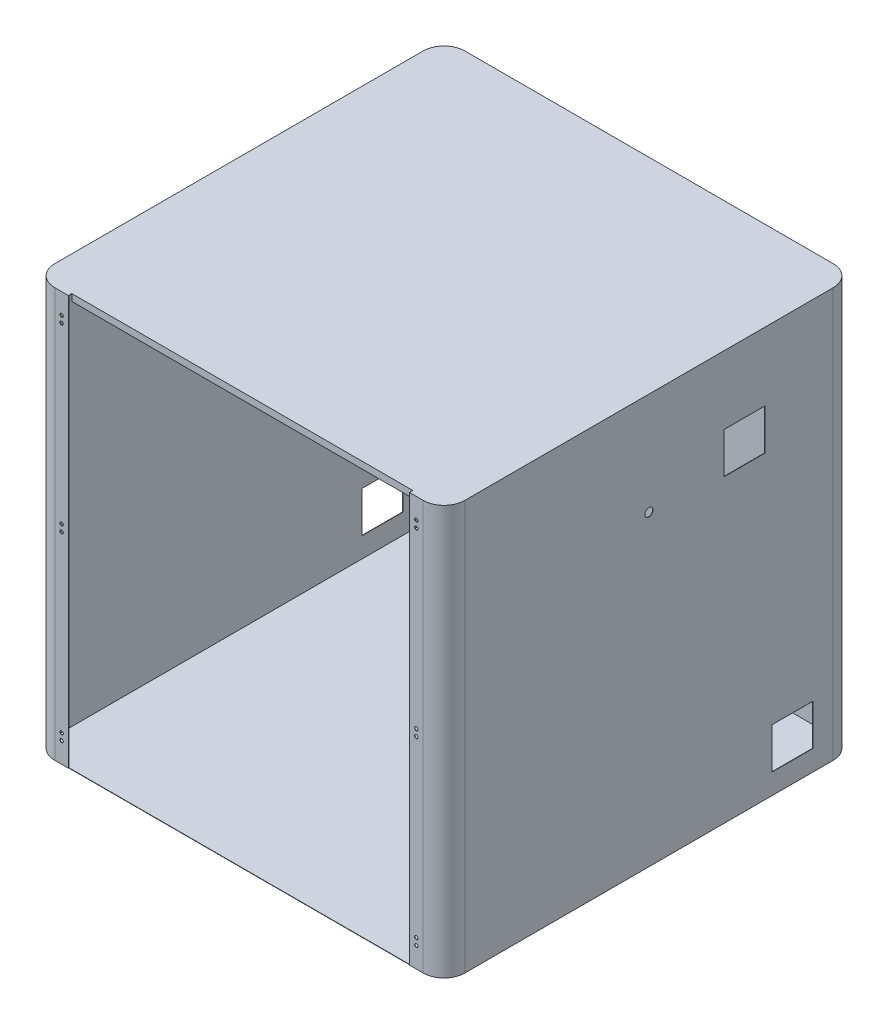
from build123d import *

# Parameters (mm, degrees)
EXTRUDE_THIN1_DEPTH = 600
SKETCH2_W           = 500
SKETCH2_H           = 600
CUT_EXTRUDE1_DEPTH  = 10
BOSS_EXTRUDE1_START = -0.5
BOSS_EXTRUDE1_DEPTH = 0.5
SKETCH5_W           = 60
SKETCH5_H           = 60
CUT_EXTRUDE2_DEPTH  = 0.5
SKETCH6_W           = 60
SKETCH6_H           = 60
CUT_EXTRUDE4_DEPTH  = 794.5
SKETCH8_W           = 500
SKETCH8_H           = 5
CUT_EXTRUDE5_DEPTH  = 78
SKETCH9_W           = 500
SKETCH9_H           = 10
BOSS_EXTRUDE6_DEPTH = 0.5
SKETCH11_R          = 2.5
CUT_EXTRUDE6_DEPTH  = 0.5
SKETCH7_R           = 6
CUT_EXTRUDE7_DEPTH  = 10


with BuildPart() as part:
    # Sketch1 → Extrude-Thin1 (new body)
    with BuildSketch(Plane(origin=(0, 0, 0), x_dir=(1, 0, 0), z_dir=(0, 1, 0))):
        with BuildLine():
            Line((-300.5, 270), (-300.5, -270))
            ThreePointArc((-300.5, -270), (-291.566756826, -291.566756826), (-270, -300.5))
            Line((-270, -300.5), (270, -300.5))
            ThreePointArc((270, -300.5), (291.566756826, -291.566756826), (300.5, -270))
            Line((300.5, -270), (300.5, 270))
            ThreePointArc((300.5, 270), (291.566756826, 291.566756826), (270, 300.5))
            Line((270, 300.5), (-270, 300.5))
            ThreePointArc((-270, 300.5), (-291.566756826, 291.566756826), (-300.5, 270))
        make_face()
        with BuildLine():
            Line((-300, 270), (-300, -270))
            ThreePointArc((-300, -270), (-291.213203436, -291.213203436), (-270, -300))
            Line((-270, -300), (270, -300))
            ThreePointArc((270, -300), (291.213203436, -291.213203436), (300, -270))
            Line((300, -270), (300, 270))
            ThreePointArc((300, 270), (291.213203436, 291.213203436), (270, 300))
            Line((270, 300), (-270, 300))
            ThreePointArc((-270, 300), (-291.213203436, 291.213203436), (-300, 270))
        make_face(mode=Mode.SUBTRACT)
    extrude(amount=EXTRUDE_THIN1_DEPTH)

    # Sketch2 → Cut-Extrude1 (cut)
    with BuildSketch(Plane.XY.offset(300.5)):
        with Locations((0, 300)):
            Rectangle(SKETCH2_W, SKETCH2_H)
    extrude(amount=-CUT_EXTRUDE1_DEPTH, mode=Mode.SUBTRACT)

    # Sketch3 → Boss-Extrude1 (add)
    with BuildSketch(Plane(origin=(0, 600, 0), x_dir=(1, 0, 0), z_dir=(0, 1, 0)).offset(BOSS_EXTRUDE1_START)):
        with BuildLine():
            Line((270, 300), (-270, 300))
            ThreePointArc((-270, 300), (-291.213203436, 291.213203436), (-300, 270))
            Line((-300, 270), (-300, -270))
            ThreePointArc((-300, -270), (-291.213203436, -291.213203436), (-270, -300))
            Line((-270, -300), (270, -300))
            ThreePointArc((270, -300), (291.213203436, -291.213203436), (300, -270))
            Line((300, -270), (300, 270))
            ThreePointArc((300, 270), (291.213203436, 291.213203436), (270, 300))
        make_face()
    boss_extrude1 = extrude(amount=BOSS_EXTRUDE1_DEPTH)

    # Mirror1: Boss-Extrude1 across plane
    add(boss_extrude1.mirror(Plane.ZX.offset(300)))

    # Sketch5 → Cut-Extrude2 (cut)
    with BuildSketch(Plane(origin=(300.5, 0, 0), x_dir=(0, 0, -1), z_dir=(1, 0, 0))):
        with Locations((140, 470)):
            Rectangle(SKETCH5_W, SKETCH5_H)
    extrude(amount=-CUT_EXTRUDE2_DEPTH, mode=Mode.SUBTRACT)

    # Sketch6 → Cut-Extrude4 (cut)
    with BuildSketch(Plane.ZY.offset(300.5)):
        with Locations((-210, 60)):
            Rectangle(SKETCH6_W, SKETCH6_H)
    extrude(amount=-CUT_EXTRUDE4_DEPTH, mode=Mode.SUBTRACT)

    # Sketch8 → Cut-Extrude5 (cut)
    with BuildSketch(Plane(origin=(0, 600, 0), x_dir=(1, 0, 0), z_dir=(0, 1, 0))):
        with Locations((0, -298)):
            Rectangle(SKETCH8_W, SKETCH8_H)
    extrude(amount=-CUT_EXTRUDE5_DEPTH, mode=Mode.SUBTRACT)

    # Sketch9 → Boss-Extrude6 (add)
    with BuildSketch(Plane.XY.offset(295.5)):
        with Locations((0, 595)):
            Rectangle(SKETCH9_W, SKETCH9_H)
    extrude(amount=-BOSS_EXTRUDE6_DEPTH)

    # Sketch11 → Cut-Extrude6 (cut)
    with BuildSketch(Plane.XY.offset(300.5)):
        with Locations((-260, 30)):
            Circle(SKETCH11_R)
        with Locations((-260, 40)):
            Circle(SKETCH11_R)
        with Locations(Location((-260, 295, 0), (0, 0, 180))):
            Circle(SKETCH11_R)
        with Locations(Location((-260, 305, 0), (0, 0, 180))):
            Circle(SKETCH11_R)
        with Locations(Location((-260, 570, 0), (0, 0, 180))):
            Circle(SKETCH11_R)
        with Locations(Location((-260, 560, 0), (0, 0, 180))):
            Circle(SKETCH11_R)
        with Locations((260, 560)):
            Circle(SKETCH11_R)
        with Locations((260, 570)):
            Circle(SKETCH11_R)
        with Locations((260, 305)):
            Circle(SKETCH11_R)
        with Locations((260, 295)):
            Circle(SKETCH11_R)
        with Locations(Location((260, 40, 0), (0, 0, 180))):
            Circle(SKETCH11_R)
        with Locations(Location((260, 30, 0), (0, 0, 180))):
            Circle(SKETCH11_R)
    extrude(amount=-CUT_EXTRUDE6_DEPTH, mode=Mode.SUBTRACT)

    # Sketch7 → Cut-Extrude7 (cut)
    with BuildSketch(Plane(origin=(300.5, 0, 0), x_dir=(0, 0, -1), z_dir=(1, 0, 0))):
        with Locations((0, 450)):
            Circle(SKETCH7_R)
    extrude(amount=-CUT_EXTRUDE7_DEPTH, mode=Mode.SUBTRACT)


solid = part.part
